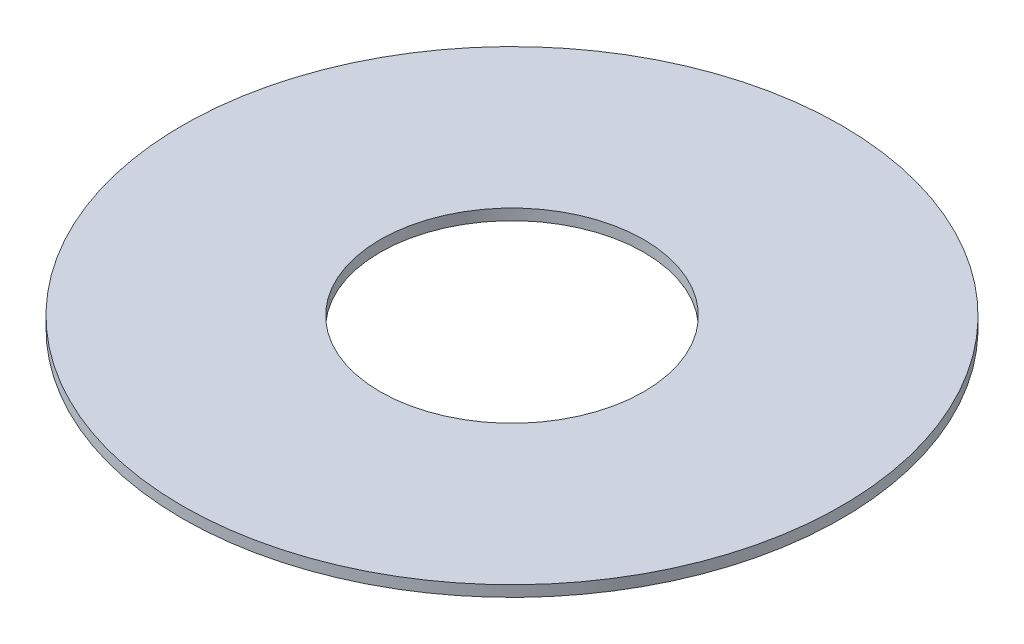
from build123d import *

# Parameters (mm, degrees)
SKETCH1_R      = 3
SKETCH1_R_2    = 1.2
EXTRUDE1_DEPTH = 0.1


with BuildPart() as part:
    # Sketch1 → Extrude1 (new body)
    with BuildSketch(Plane(origin=(0, 0, 0), x_dir=(1, 0, 0), z_dir=(0, 1, 0))):
        with Locations(Location((0, 0, 0), (0, 0, 270))):
            Circle(SKETCH1_R)
        with Locations(Location((0, 0, 0), (0, 0, 270))):
            Circle(SKETCH1_R_2, mode=Mode.SUBTRACT)
    extrude(amount=EXTRUDE1_DEPTH)


solid = part.part
